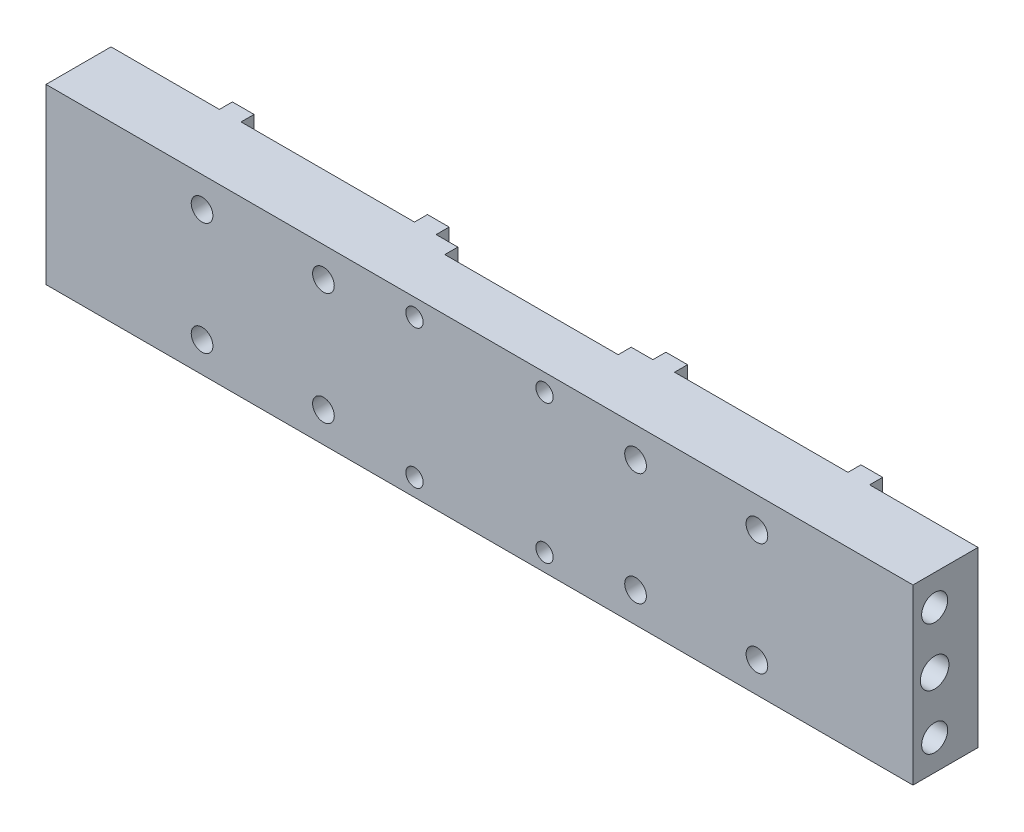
from build123d import *
from build123d.topology import SkipClean

# Parameters (mm, degrees)
ESQUISSE1_R              = 2.4999999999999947
ESQUISSE1_R_2            = 2.5000000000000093
ESQUISSE1_R_3            = 2.4999999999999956
ESQUISSE1_R_4            = 2.0000000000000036
ESQUISSE1_R_5            = 2
EXTRUSION1_DEPTH         = 12
BOSS_EXTRU_1_START       = 3
ESQUISSE3_W              = 80.00000000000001
ESQUISSE3_H              = 40.00000000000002
ESQUISSE3_R              = 2.4999999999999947
ESQUISSE3_R_2            = 2.499999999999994
ESQUISSE3_R_3            = 2.5000000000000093
ESQUISSE3_R_4            = 2.4999999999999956
BOSS_EXTRU_1_DEPTH       = 3
ESQUISSE4_R              = 2.9999999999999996
ESQUISSE4_R_2            = 3.0000000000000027
ENL_V_MAT_EXTRU_1_DEPTH  = 8
ENL_V_START              = -8
ESQUISSE5_R              = 2.9999999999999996
ESQUISSE5_R_2            = 3.000000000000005
ENL_V_MAT_EXTRU_2_DEPTH  = 8
ESQUISSE6_W              = 5.000000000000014
ESQUISSE6_H              = 40.00000000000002
BOSS_EXTRU_2_DEPTH       = 3
TROU_TARAUD_G1_161_D     = 6.6
TROU_TARAUD_G1_161_DEPTH = 12.72
TROU_TARAUD_G1_161_TIP   = 1.982840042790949
TROU_TARAUD_G1_162_D     = 6.6
TROU_TARAUD_G1_162_DEPTH = 12.72
TROU_TARAUD_G1_162_TIP   = 1.982840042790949


with BuildPart() as part:
    # Esquisse1 → Extrusion1 (new body)
    with BuildSketch(Plane.XY):
        Polygon((-99.99999999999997, -13.607626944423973), (100.00000000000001, -13.607626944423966), (100.00000000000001, -53.60762694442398), (-99.99999999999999, -53.60762694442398), align=None)
        with Locations((-64, -20.607626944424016)):
            Circle(ESQUISSE1_R, mode=Mode.SUBTRACT)
        with Locations((-36.00000000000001, -20.607626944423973)):
            Circle(ESQUISSE1_R_2, mode=Mode.SUBTRACT)
        with Locations((-64, -46.607626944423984)):
            Circle(ESQUISSE1_R_3, mode=Mode.SUBTRACT)
        with Locations((-35.99999999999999, -46.60762694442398)):
            Circle(ESQUISSE1_R_3, mode=Mode.SUBTRACT)
        with Locations((36.00000000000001, -20.607626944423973)):
            Circle(ESQUISSE1_R, mode=Mode.SUBTRACT)
        with Locations((64, -20.607626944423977)):
            Circle(ESQUISSE1_R_3, mode=Mode.SUBTRACT)
        with Locations((36.00000000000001, -46.60762694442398)):
            Circle(ESQUISSE1_R_3, mode=Mode.SUBTRACT)
        with Locations((64, -46.607626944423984)):
            Circle(ESQUISSE1_R_3, mode=Mode.SUBTRACT)
        with Locations((15.000000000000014, -17.607626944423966)):
            Circle(ESQUISSE1_R_4, mode=Mode.SUBTRACT)
        with Locations((15.000000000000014, -49.60762694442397)):
            Circle(ESQUISSE1_R_4, mode=Mode.SUBTRACT)
        with Locations((-14.999999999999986, -17.607626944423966)):
            Circle(ESQUISSE1_R_5, mode=Mode.SUBTRACT)
        with Locations((-14.999999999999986, -49.60762694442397)):
            Circle(ESQUISSE1_R_5, mode=Mode.SUBTRACT)
    extrude(amount=EXTRUSION1_DEPTH)

    # Esquisse3 → Boss.-Extru.1 (add)
    # profile 1 of 2: a face of its own
    with SkipClean():  # the faces are left unmerged after this step: merging them gives an invalid solid
        with BuildSketch(Plane(origin=(0, 0, 0), x_dir=(-1, 0, 0), z_dir=(0, 0, -1)).offset(BOSS_EXTRU_1_START)):
            with Locations((-60.00000000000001, -33.60762694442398)):
                Rectangle(ESQUISSE3_W, ESQUISSE3_H)
            with Locations((-36.00000000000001, -20.607626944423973)):
                Circle(ESQUISSE3_R, mode=Mode.SUBTRACT)
            with Locations((-64, -20.607626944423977)):
                Circle(ESQUISSE3_R, mode=Mode.SUBTRACT)
            with Locations((-36.00000000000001, -46.60762694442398)):
                Circle(ESQUISSE3_R_2, mode=Mode.SUBTRACT)
            with Locations((-64, -46.607626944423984)):
                Circle(ESQUISSE3_R_3, mode=Mode.SUBTRACT)
        # profile 2 of 2: a face of its own
        with BuildSketch(Plane(origin=(0, 0, 0), x_dir=(-1, 0, 0), z_dir=(0, 0, -1)).offset(BOSS_EXTRU_1_START)):
            Polygon((99.99999999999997, -13.607626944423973), (19.99999999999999, -13.607626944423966), (19.99999999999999, -53.607626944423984), (99.99999999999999, -53.60762694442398), align=None)
            with Locations((64, -20.607626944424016)):
                Circle(ESQUISSE3_R, mode=Mode.SUBTRACT)
            with Locations((36.00000000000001, -20.607626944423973)):
                Circle(ESQUISSE3_R_3, mode=Mode.SUBTRACT)
            with Locations((64, -46.607626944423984)):
                Circle(ESQUISSE3_R_4, mode=Mode.SUBTRACT)
            with Locations((35.99999999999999, -46.60762694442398)):
                Circle(ESQUISSE3_R_4, mode=Mode.SUBTRACT)
        extrude(amount=-BOSS_EXTRU_1_DEPTH)

    # Esquisse4 → Enl_v. mat.-Extru.1 (cut)
    with SkipClean():  # the faces are left unmerged after this step: merging them gives an invalid solid
        with BuildSketch(Plane.ZY.offset(99.99999999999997)):
            with Locations(Location((7, -20.60762694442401, 0), (0, 0, 270))):
                Circle(ESQUISSE4_R)
            with Locations(Location((7, -46.60762694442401, 0), (0, 0, 270))):
                Circle(ESQUISSE4_R_2)
        extrude(amount=-ENL_V_MAT_EXTRU_1_DEPTH, mode=Mode.SUBTRACT)

    # Esquisse5 → Enl_v. mat.-Extru.2 (cut)
    with SkipClean():  # the faces are left unmerged after this step: merging them gives an invalid solid
        with BuildSketch(Plane(origin=(100.00000000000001, 0, 0), x_dir=(0, 0, -1), z_dir=(1, 0, 0)).offset(ENL_V_START)):
            with Locations(Location((-7, -20.607626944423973, 0), (0, 0, 270))):
                Circle(ESQUISSE5_R)
            with Locations(Location((-7.000000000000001, -46.60762694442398, 0), (0, 0, 270))):
                Circle(ESQUISSE5_R_2)
        extrude(amount=ENL_V_MAT_EXTRU_2_DEPTH, mode=Mode.SUBTRACT)

    # Esquisse6 → Boss.-Extru.2 (add)
    with SkipClean():  # the faces are left unmerged after this step: merging them gives an invalid solid
        with BuildSketch(Plane(origin=(0, 0, -3), x_dir=(-1, 0, 0), z_dir=(0, 0, -1))):
            Polygon((-30.000000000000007, -13.607626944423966), (-25.000000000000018, -13.607626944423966), (-25.00000000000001, -53.60762694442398), (-30.000000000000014, -53.60762694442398), align=None)
            Polygon((24.999999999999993, -13.607626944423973), (30, -13.607626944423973), (30, -53.607626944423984), (24.999999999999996, -53.607626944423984), align=None)
            with Locations((-72.5, -33.60762694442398)):
                Rectangle(ESQUISSE6_W, ESQUISSE6_H)
            Polygon((69.99999999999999, -13.607626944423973), (75, -13.607626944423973), (75.00000000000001, -53.607626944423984), (70, -53.607626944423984), align=None)
        extrude(amount=BOSS_EXTRU_2_DEPTH)

    # Trou taraud_ G1_161
    with Locations(Plane.ZY.offset(99.99999999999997)):
        with Locations((7, -33.607626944)):
            Hole(TROU_TARAUD_G1_161_D / 2, depth=TROU_TARAUD_G1_161_DEPTH)
            with Locations((0, 0, -(TROU_TARAUD_G1_161_DEPTH + TROU_TARAUD_G1_161_TIP / 2))):  # 118° drill point
                Cone(0, TROU_TARAUD_G1_161_D / 2, TROU_TARAUD_G1_161_TIP, mode=Mode.SUBTRACT)

    # Trou taraud_ G1_162
    with Locations(Plane(origin=(100.00000000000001, 0, 0), x_dir=(0, 0, -1), z_dir=(1, 0, 0))):
        with Locations((-7, -33.607626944)):
            Hole(TROU_TARAUD_G1_162_D / 2, depth=TROU_TARAUD_G1_162_DEPTH)
            with Locations((0, 0, -(TROU_TARAUD_G1_162_DEPTH + TROU_TARAUD_G1_162_TIP / 2))):  # 118° drill point
                Cone(0, TROU_TARAUD_G1_162_D / 2, TROU_TARAUD_G1_162_TIP, mode=Mode.SUBTRACT)


solid = part.part
